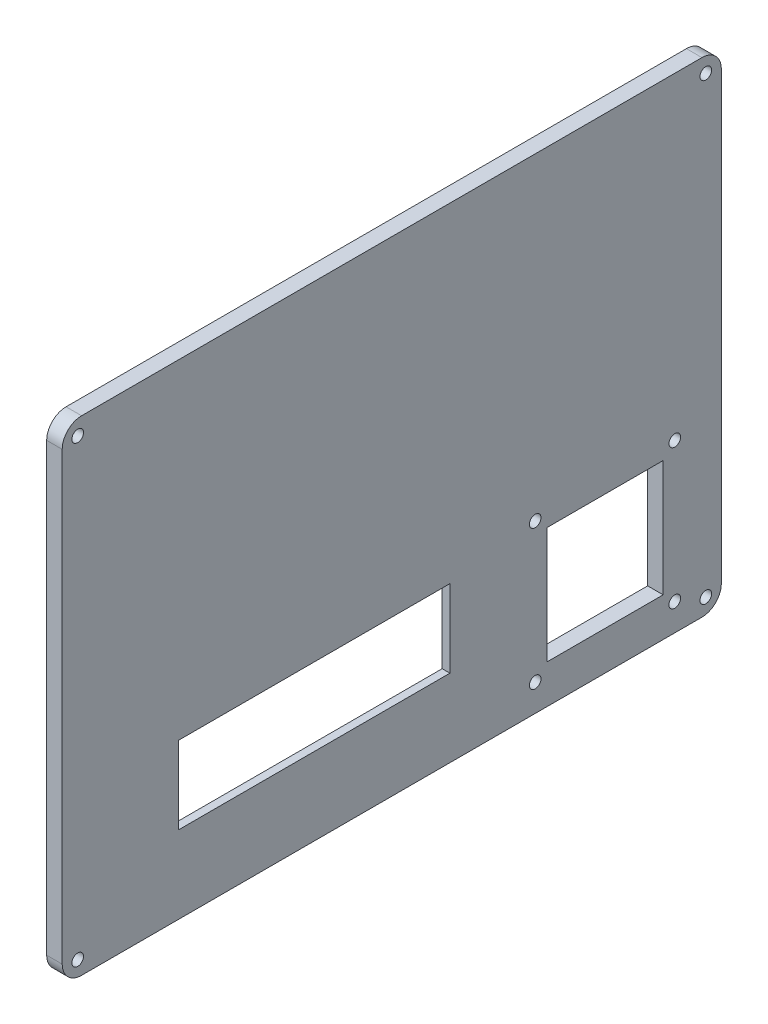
from build123d import *

# Parameters (mm, degrees)
SKETCH1_W           = 170
SKETCH1_H           = 125
SKETCH1_W_2         = 30
SKETCH1_H_2         = 30
SKETCH1_W_3         = 70
SKETCH1_H_3         = 20
BOSS_EXTRUDE1_DEPTH = 4
CUT_EXTRUDE1_DEPTH  = 10
CUT_EXTRUDE2_DEPTH  = 10
FILLET1_R           = 5
SKETCH4_W           = 76
SKETCH4_H           = 26
CUT_EXTRUDE3_DEPTH  = 2


with BuildPart() as part:
    # Sketch1 → Boss-Extrude1 (new body)
    with BuildSketch(Plane(origin=(0, 0, 0), x_dir=(0, 0, -1), z_dir=(1, 0, 0))):
        Rectangle(SKETCH1_W, SKETCH1_H)
        with Locations((55, -37.5)):
            Rectangle(SKETCH1_W_2, SKETCH1_H_2, mode=Mode.SUBTRACT)
        with Locations((-20, -32.5)):
            Rectangle(SKETCH1_W_3, SKETCH1_H_3, mode=Mode.SUBTRACT)
    extrude(amount=BOSS_EXTRUDE1_DEPTH)

    # Sketch2 → Cut-Extrude1 (cut)
    with BuildSketch(Plane(origin=(4, 0, 0), x_dir=(0, 0, -1), z_dir=(1, 0, 0))):
        with BuildLine():
            ThreePointArc((71.5, -19.5), (71.939339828, -20.560660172), (73, -21))
            Line((73, -21), (73, -19.5))
            Line((73, -19.5), (71.5, -19.5))
        make_face()
        with BuildLine():
            Line((73, -19.5), (73, -21))
            ThreePointArc((73, -21), (74.060660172, -20.560660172), (74.5, -19.5))
            ThreePointArc((74.5, -19.5), (73, -18), (71.5, -19.5))
            Line((71.5, -19.5), (73, -19.5))
        make_face()
        with BuildLine():
            ThreePointArc((71.5, -19.5), (71.939339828, -20.560660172), (73, -21))
            Line((73, -21), (73, -19.5))
            Line((73, -19.5), (71.5, -19.5))
        make_face()
        with BuildLine():
            Line((73, -19.5), (73, -21))
            ThreePointArc((73, -21), (74.060660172, -20.560660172), (74.5, -19.5))
            ThreePointArc((74.5, -19.5), (73, -18), (71.5, -19.5))
            Line((71.5, -19.5), (73, -19.5))
        make_face()
        with BuildLine():
            ThreePointArc((38.5, -19.5), (35.939339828, -18.439339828), (37, -21))
            Line((37, -21), (37, -19.5))
            Line((37, -19.5), (38.5, -19.5))
        make_face()
        with BuildLine():
            Line((37, -19.5), (37, -21))
            ThreePointArc((37, -21), (38.060660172, -20.560660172), (38.5, -19.5))
            Line((38.5, -19.5), (37, -19.5))
        make_face()
        with BuildLine():
            ThreePointArc((38.5, -19.5), (35.939339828, -18.439339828), (37, -21))
            Line((37, -21), (37, -19.5))
            Line((37, -19.5), (38.5, -19.5))
        make_face()
        with BuildLine():
            Line((37, -19.5), (37, -21))
            ThreePointArc((37, -21), (38.060660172, -20.560660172), (38.5, -19.5))
            Line((38.5, -19.5), (37, -19.5))
        make_face()
        with BuildLine():
            Line((37, -54), (37, -55.5))
            Line((37, -55.5), (38.5, -55.5))
            ThreePointArc((38.5, -55.5), (38.060660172, -54.439339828), (37, -54))
        make_face()
        with BuildLine():
            Line((38.5, -55.5), (37, -55.5))
            Line((37, -55.5), (37, -54))
            ThreePointArc((37, -54), (35.939339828, -56.560660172), (38.5, -55.5))
        make_face()
        with BuildLine():
            Line((37, -54), (37, -55.5))
            Line((37, -55.5), (38.5, -55.5))
            ThreePointArc((38.5, -55.5), (38.060660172, -54.439339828), (37, -54))
        make_face()
        with BuildLine():
            Line((38.5, -55.5), (37, -55.5))
            Line((37, -55.5), (37, -54))
            ThreePointArc((37, -54), (35.939339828, -56.560660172), (38.5, -55.5))
        make_face()
        with BuildLine():
            ThreePointArc((73, -54), (71.939339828, -54.439339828), (71.5, -55.5))
            Line((71.5, -55.5), (73, -55.5))
            Line((73, -55.5), (73, -54))
        make_face()
        with BuildLine():
            Line((73, -55.5), (71.5, -55.5))
            ThreePointArc((71.5, -55.5), (73, -57), (74.5, -55.5))
            ThreePointArc((74.5, -55.5), (74.060660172, -54.439339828), (73, -54))
            Line((73, -54), (73, -55.5))
        make_face()
        with BuildLine():
            ThreePointArc((73, -54), (71.939339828, -54.439339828), (71.5, -55.5))
            Line((71.5, -55.5), (73, -55.5))
            Line((73, -55.5), (73, -54))
        make_face()
        with BuildLine():
            Line((73, -55.5), (71.5, -55.5))
            ThreePointArc((71.5, -55.5), (73, -57), (74.5, -55.5))
            ThreePointArc((74.5, -55.5), (74.060660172, -54.439339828), (73, -54))
            Line((73, -54), (73, -55.5))
        make_face()
    extrude(amount=-CUT_EXTRUDE1_DEPTH, mode=Mode.SUBTRACT)

    # Sketch3 → Cut-Extrude2 (cut)
    with BuildSketch(Plane(origin=(4, 0, 0), x_dir=(0, 0, -1), z_dir=(1, 0, 0))):
        with BuildLine():
            ThreePointArc((-81, 57), (-79.939339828, 57.439339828), (-79.5, 58.5))
            Line((-79.5, 58.5), (-81, 58.5))
            Line((-81, 58.5), (-81, 57))
        make_face()
        with BuildLine():
            Line((-81, 58.5), (-79.5, 58.5))
            ThreePointArc((-79.5, 58.5), (-82.060660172, 59.560660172), (-81, 57))
            Line((-81, 57), (-81, 58.5))
        make_face()
        with BuildLine():
            ThreePointArc((79.5, 58.5), (79.939339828, 57.439339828), (81, 57))
            Line((81, 57), (81, 58.5))
            Line((81, 58.5), (79.5, 58.5))
        make_face()
        with BuildLine():
            Line((81, 58.5), (81, 57))
            ThreePointArc((81, 57), (82.060660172, 57.439339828), (82.5, 58.5))
            ThreePointArc((82.5, 58.5), (81, 60), (79.5, 58.5))
            Line((79.5, 58.5), (81, 58.5))
        make_face()
        with BuildLine():
            ThreePointArc((79.5, 58.5), (79.939339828, 57.439339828), (81, 57))
            Line((81, 57), (81, 58.5))
            Line((81, 58.5), (79.5, 58.5))
        make_face()
        with BuildLine():
            Line((81, 58.5), (81, 57))
            ThreePointArc((81, 57), (82.060660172, 57.439339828), (82.5, 58.5))
            ThreePointArc((82.5, 58.5), (81, 60), (79.5, 58.5))
            Line((79.5, 58.5), (81, 58.5))
        make_face()
        with BuildLine():
            Line((79.5, -58.5), (81, -58.5))
            Line((81, -58.5), (81, -57))
            ThreePointArc((81, -57), (79.939339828, -57.439339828), (79.5, -58.5))
        make_face()
        with BuildLine():
            Line((81, -57), (81, -58.5))
            Line((81, -58.5), (79.5, -58.5))
            ThreePointArc((79.5, -58.5), (81, -60), (82.5, -58.5))
            ThreePointArc((82.5, -58.5), (82.060660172, -57.439339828), (81, -57))
        make_face()
        with BuildLine():
            Line((79.5, -58.5), (81, -58.5))
            Line((81, -58.5), (81, -57))
            ThreePointArc((81, -57), (79.939339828, -57.439339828), (79.5, -58.5))
        make_face()
        with BuildLine():
            Line((81, -57), (81, -58.5))
            Line((81, -58.5), (79.5, -58.5))
            ThreePointArc((79.5, -58.5), (81, -60), (82.5, -58.5))
            ThreePointArc((82.5, -58.5), (82.060660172, -57.439339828), (81, -57))
        make_face()
        with BuildLine():
            ThreePointArc((-81, -57), (-82.060660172, -59.560660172), (-79.5, -58.5))
            Line((-79.5, -58.5), (-81, -58.5))
            Line((-81, -58.5), (-81, -57))
        make_face()
        with BuildLine():
            Line((-81, -58.5), (-79.5, -58.5))
            ThreePointArc((-79.5, -58.5), (-79.939339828, -57.439339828), (-81, -57))
            Line((-81, -57), (-81, -58.5))
        make_face()
        with BuildLine():
            ThreePointArc((-81, -57), (-82.060660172, -59.560660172), (-79.5, -58.5))
            Line((-79.5, -58.5), (-81, -58.5))
            Line((-81, -58.5), (-81, -57))
        make_face()
        with BuildLine():
            Line((-81, -58.5), (-79.5, -58.5))
            ThreePointArc((-79.5, -58.5), (-79.939339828, -57.439339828), (-81, -57))
            Line((-81, -57), (-81, -58.5))
        make_face()
        with BuildLine():
            ThreePointArc((-81, 57), (-79.939339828, 57.439339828), (-79.5, 58.5))
            Line((-79.5, 58.5), (-81, 58.5))
            Line((-81, 58.5), (-81, 57))
        make_face()
        with BuildLine():
            Line((-81, 58.5), (-79.5, 58.5))
            ThreePointArc((-79.5, 58.5), (-82.060660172, 59.560660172), (-81, 57))
            Line((-81, 57), (-81, 58.5))
        make_face()
    extrude(amount=-CUT_EXTRUDE2_DEPTH, mode=Mode.SUBTRACT)

    # Fillet1
    fillet1_edges = [part.edges().sort_by_distance(p)[0] for p in [
        (2, -62.5, -85),
        (2, -62.5, 85),
        (2, 62.5, 85),
        (2, 62.5, -85),
    ]]
    fillet(fillet1_edges, radius=FILLET1_R)

    # Sketch4 → Cut-Extrude3 (cut)
    with BuildSketch(Plane.ZY):
        with Locations((20, -32.5)):
            Rectangle(SKETCH4_W, SKETCH4_H)
    extrude(amount=-CUT_EXTRUDE3_DEPTH, mode=Mode.SUBTRACT)


solid = part.part
